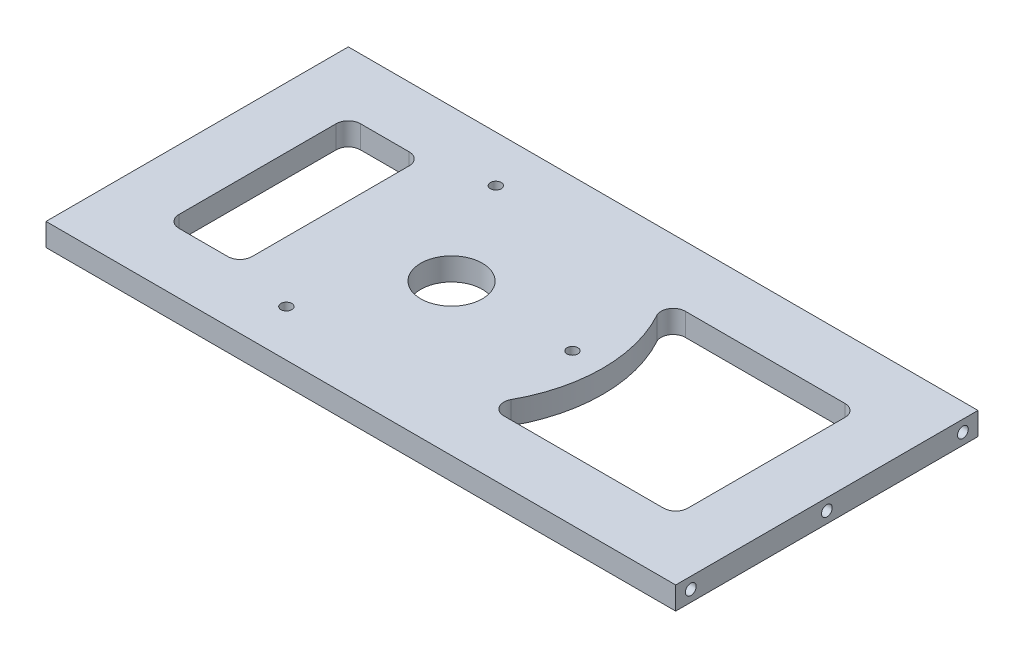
from build123d import *

# Parameters (mm, degrees)
SKETCH1_W           = 132.2705
SKETCH1_H           = 63.5
BOSS_EXTRUDE1_DEPTH = 4.7625
SKETCH2_R           = 1.1303
CUT_EXTRUDE1_DEPTH  = 10.16
SKETCH3_R           = 6.477
CUT_EXTRUDE2_DEPTH  = 74.516088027
SKETCH4_R           = 1.143
CUT_EXTRUDE3_DEPTH  = 74.516088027
SKETCH5_W           = 15.33525
SKETCH5_H           = 38.1
CUT_EXTRUDE4_DEPTH  = 74.516088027
FILLET1_R           = 2.54


with BuildPart() as part:
    # Sketch1 → Boss-Extrude1 (new body)
    with BuildSketch(Plane(origin=(0, 0, 0), x_dir=(1, 0, 0), z_dir=(0, 1, 0))):
        Rectangle(SKETCH1_W, SKETCH1_H)
    extrude(amount=BOSS_EXTRUDE1_DEPTH)

    # Sketch2 → Cut-Extrude1 (cut)
    with BuildSketch(Plane.ZY.offset(66.13525)):
        with Locations((-28.575, 2.38125)):
            Circle(SKETCH2_R)
        with Locations(Location((28.575, 2.38125, 0), (0, 0, 180))):
            Circle(SKETCH2_R)
        with Locations((0, 2.38125)):
            Circle(SKETCH2_R)
    cut_extrude1 = extrude(amount=-CUT_EXTRUDE1_DEPTH, mode=Mode.SUBTRACT)

    # Mirror1: Cut-Extrude1 across plane
    add(cut_extrude1.mirror(Plane(origin=(0, 0, 0), x_dir=(0, 0, 1), z_dir=(1, 0, 0))), mode=Mode.SUBTRACT)

    # Sketch3 → Cut-Extrude2 (cut, through all)
    with BuildSketch(Plane(origin=(0, 4.7625, 0), x_dir=(1, 0, 0), z_dir=(0, 1, 0))):
        with Locations(Location((-12.7, 0, 0), (0, 0, 270))):
            Circle(SKETCH3_R)
    extrude(amount=-CUT_EXTRUDE2_DEPTH, mode=Mode.SUBTRACT)

    # Sketch4 → Cut-Extrude3 (cut, through all)
    with BuildSketch(Plane(origin=(0, 4.7625, 0), x_dir=(1, 0, 0), z_dir=(0, 1, 0))):
        with Locations(Location((-25.4, 21.997045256, 0), (0, 0, 270))):
            Circle(SKETCH4_R)
        with Locations(Location((12.7, 0, 0), (0, 0, 270))):
            Circle(SKETCH4_R)
        with Locations(Location((-25.4, -21.997045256, 0), (0, 0, 270))):
            Circle(SKETCH4_R)
    extrude(amount=-CUT_EXTRUDE3_DEPTH, mode=Mode.SUBTRACT)

    # Sketch5 → Cut-Extrude4 (cut, through all)
    with BuildSketch(Plane(origin=(0, 4.7625, 0), x_dir=(1, 0, 0), z_dir=(0, 1, 0))):
        with BuildLine():
            Line((53.43525, 19.05), (12.7, 19.05))
            ThreePointArc((12.7, 19.05), (19.05, 0), (12.7, -19.05))
            Line((12.7, -19.05), (53.43525, -19.05))
            Line((53.43525, -19.05), (53.43525, 19.05))
        make_face()
        with Locations((-45.767625, 0)):
            Rectangle(SKETCH5_W, SKETCH5_H)
    extrude(amount=-CUT_EXTRUDE4_DEPTH, mode=Mode.SUBTRACT)

    # Fillet1
    fillet1_edges = [part.edges().sort_by_distance(p)[0] for p in [
        (-53.43525, 2.38125, -19.05),
        (-38.1, 2.38125, -19.05),
        (-38.1, 2.38125, 19.05),
        (-53.43525, 2.38125, 19.05),
        (53.43525, 2.38125, -19.05),
        (53.43525, 2.38125, 19.05),
        (12.7, 2.38125, 19.05),
        (12.7, 2.38125, -19.05),
    ]]
    fillet(fillet1_edges, radius=FILLET1_R)


solid = part.part
